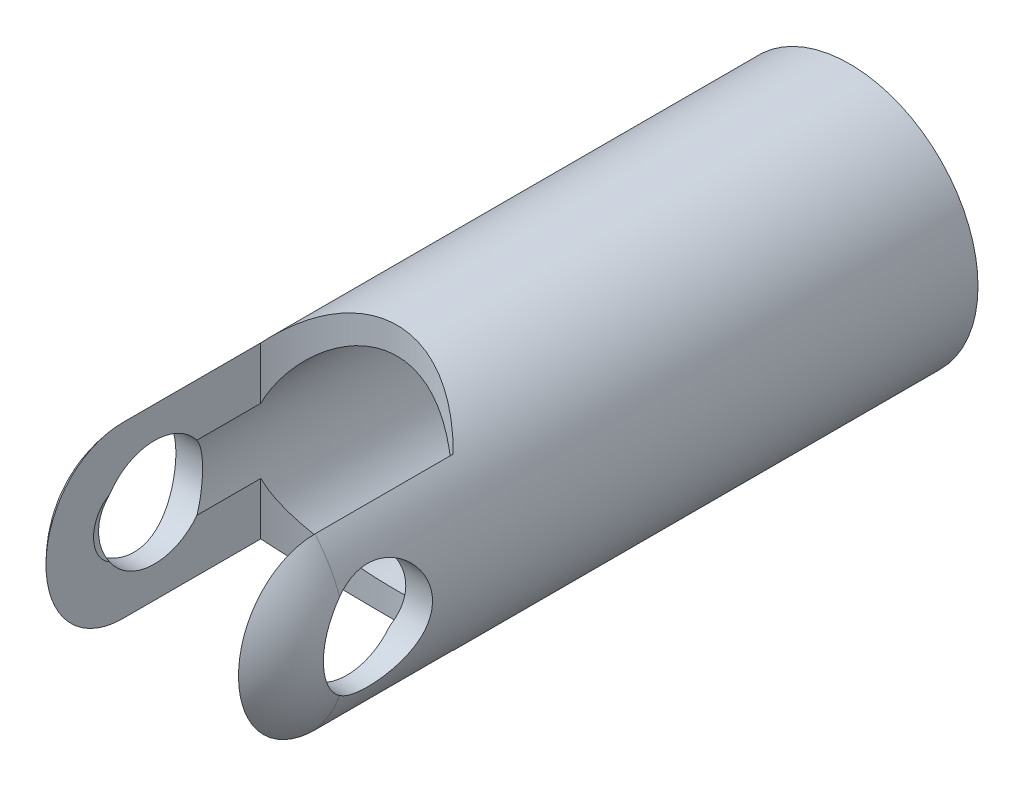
from build123d import *

# Parameters (mm, degrees)
CROQUIS1_R                 = 6
SALIENTE_EXTRUIR1_DEPTH    = 34.5
REDONDEO1_R                = 5
VACIADO1_T                 = -1.25
CORTAR_EXTRUIR1_DEPTH      = 34
CORTAR_EXTRUIR1_DEPTH_BACK = 34
CORTAR_EXTRUIR2_DEPTH      = 34
CORTAR_EXTRUIR2_DEPTH_BACK = 34
CROQUIS3_R                 = 2.5


with BuildPart() as part:
    # Croquis1 → Saliente-Extruir1 (new body)
    with BuildSketch(Plane.XY):
        Circle(CROQUIS1_R)
    extrude(amount=SALIENTE_EXTRUIR1_DEPTH)

    # Redondeo1
    redondeo1_edges = [part.edges().sort_by_distance(p)[0] for p in [
        (-6, 0, 34.5),
    ]]
    fillet(redondeo1_edges, radius=REDONDEO1_R)

    # Vaciado1
    vaciado1_openings = [part.faces().sort_by_distance(p)[0] for p in [
        (0, 0, 0),
    ]]
    offset(amount=VACIADO1_T, openings=vaciado1_openings, kind=Kind.INTERSECTION)

    # Croquis2 → Cortar-Extruir1 (cut, two sides: drawn at the far end of the back side and taken through both)
    with BuildSketch(Plane(origin=(0, 0, 0), x_dir=(1, 0, 0), z_dir=(0, 1, 0)).offset(-CORTAR_EXTRUIR1_DEPTH_BACK)):
        with BuildLine():
            Line((4.5, -34.5), (-4.5, -34.5))
            Line((-4.5, -34.5), (-4.5, -23.031373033))
            ThreePointArc((-4.5, -23.031373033), (0, -21.158184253), (4.5, -23.031373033))
            Line((4.5, -23.031373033), (4.5, -34.5))
        make_face()
    extrude(amount=CORTAR_EXTRUIR1_DEPTH + CORTAR_EXTRUIR1_DEPTH_BACK, mode=Mode.SUBTRACT)

    # Croquis3 → Cortar-Extruir2 (cut, two sides: drawn at the far end of the back side and taken through both)
    with BuildSketch(Plane(origin=(0, 0, 0), x_dir=(0, 0, -1), z_dir=(1, 0, 0)).offset(-CORTAR_EXTRUIR2_DEPTH_BACK)):
        with Locations(Location((-28, 0, 0), (0, 0, 213.109520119))):
            Circle(CROQUIS3_R)
    extrude(amount=CORTAR_EXTRUIR2_DEPTH + CORTAR_EXTRUIR2_DEPTH_BACK, mode=Mode.SUBTRACT)


solid = part.part
